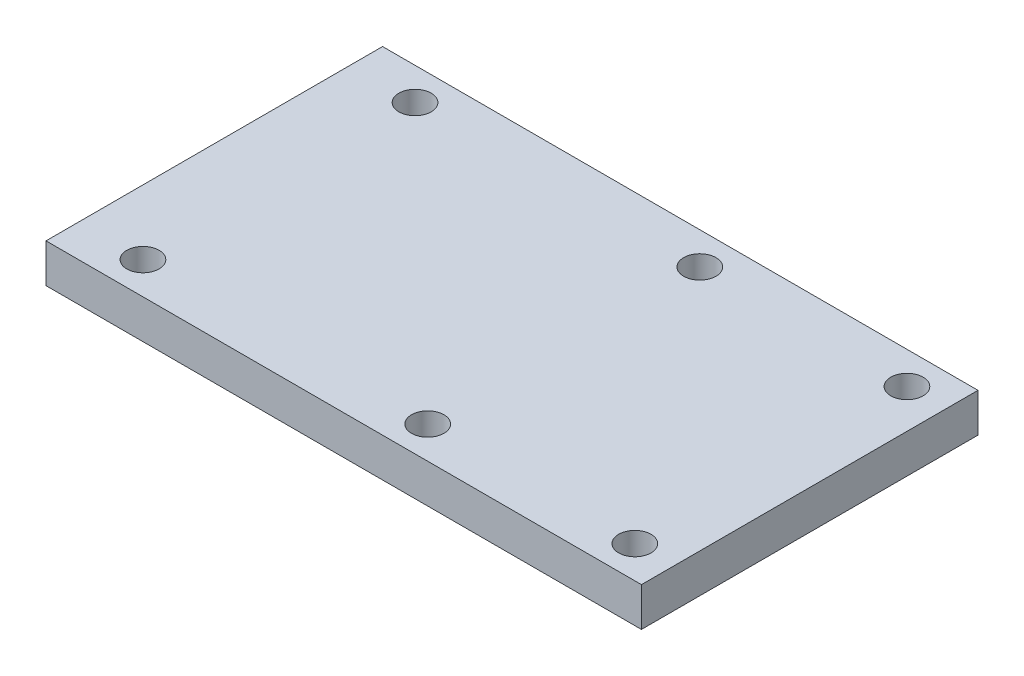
ISO-10303-21;
HEADER;
FILE_DESCRIPTION(('STEP AP214'),'2;1');
FILE_NAME('part.step','',(''),(''),'','','');
FILE_SCHEMA(('AUTOMOTIVE_DESIGN { 1 0 10303 214 1 1 1 1 }'));
ENDSEC;
DATA;
#1=APPLICATION_CONTEXT('core data for automotive mechanical design processes');
#2=APPLICATION_PROTOCOL_DEFINITION('international standard','automotive_design',2000,#1);
#3=PRODUCT_CONTEXT('',#1,'mechanical');
#4=PRODUCT('Part','Part','',(#3));
#5=PRODUCT_RELATED_PRODUCT_CATEGORY('part','',(#4));
#6=PRODUCT_DEFINITION_FORMATION('','',#4);
#7=PRODUCT_DEFINITION_CONTEXT('part definition',#1,'design');
#8=PRODUCT_DEFINITION('design','',#6,#7);
#9=PRODUCT_DEFINITION_SHAPE('','',#8);
#10=(LENGTH_UNIT() NAMED_UNIT(*) SI_UNIT(.MILLI.,.METRE.));
#11=(NAMED_UNIT(*) PLANE_ANGLE_UNIT() SI_UNIT($,.RADIAN.));
#12=(NAMED_UNIT(*) SI_UNIT($,.STERADIAN.) SOLID_ANGLE_UNIT());
#13=UNCERTAINTY_MEASURE_WITH_UNIT(LENGTH_MEASURE(1.E-05),#10,'distance_accuracy_value','');
#14=(GEOMETRIC_REPRESENTATION_CONTEXT(3) GLOBAL_UNCERTAINTY_ASSIGNED_CONTEXT((#13)) GLOBAL_UNIT_ASSIGNED_CONTEXT((#10,
#11,#12)) REPRESENTATION_CONTEXT('',''));
#15=CARTESIAN_POINT('',(0.,0.,0.));
#16=DIRECTION('',(0.,0.,1.));
#17=DIRECTION('',(1.,0.,0.));
#18=AXIS2_PLACEMENT_3D('',#15,#16,#17);
#19=CARTESIAN_POINT('',(-100.,15.,-70.));
#20=DIRECTION('',(0.,0.,1.));
#21=DIRECTION('',(1.,0.,0.));
#22=AXIS2_PLACEMENT_3D('',#19,#20,#21);
#23=PLANE('',#22);
#24=DIRECTION('',(-1.,0.,0.));
#25=VECTOR('',#24,1.);
#26=CARTESIAN_POINT('',(-100.,0.,-70.));
#27=LINE('',#26,#25);
#28=CARTESIAN_POINT('',(130.,0.,-70.));
#29=VERTEX_POINT('',#28);
#30=CARTESIAN_POINT('',(-100.,0.,-70.));
#31=VERTEX_POINT('',#30);
#32=EDGE_CURVE('E62',#29,#31,#27,.T.);
#33=ORIENTED_EDGE('',*,*,#32,.T.);
#34=DIRECTION('',(0.,-1.,0.));
#35=VECTOR('',#34,1.);
#36=CARTESIAN_POINT('',(-100.,15.,-70.));
#37=LINE('',#36,#35);
#38=CARTESIAN_POINT('',(-100.,15.,-70.));
#39=VERTEX_POINT('',#38);
#40=EDGE_CURVE('E11',#39,#31,#37,.T.);
#41=ORIENTED_EDGE('',*,*,#40,.F.);
#42=DIRECTION('',(-1.,0.,0.));
#43=VECTOR('',#42,1.);
#44=CARTESIAN_POINT('',(-100.,15.,-70.));
#45=LINE('',#44,#43);
#46=CARTESIAN_POINT('',(130.,15.,-70.));
#47=VERTEX_POINT('',#46);
#48=EDGE_CURVE('E87',#47,#39,#45,.T.);
#49=ORIENTED_EDGE('',*,*,#48,.F.);
#50=DIRECTION('',(0.,1.,0.));
#51=VECTOR('',#50,1.);
#52=CARTESIAN_POINT('',(130.,0.,-70.));
#53=LINE('',#52,#51);
#54=EDGE_CURVE('E95',#29,#47,#53,.T.);
#55=ORIENTED_EDGE('',*,*,#54,.F.);
#56=EDGE_LOOP('',(#33,#41,#49,#55));
#57=FACE_BOUND('',#56,.T.);
#58=ADVANCED_FACE('F33',(#57),#23,.F.);
#59=CARTESIAN_POINT('',(-100.,15.,60.));
#60=DIRECTION('',(1.,0.,0.));
#61=DIRECTION('',(0.,0.,-1.));
#62=AXIS2_PLACEMENT_3D('',#59,#60,#61);
#63=PLANE('',#62);
#64=DIRECTION('',(0.,0.,1.));
#65=VECTOR('',#64,1.);
#66=CARTESIAN_POINT('',(-100.,0.,60.));
#67=LINE('',#66,#65);
#68=CARTESIAN_POINT('',(-100.,0.,60.));
#69=VERTEX_POINT('',#68);
#70=EDGE_CURVE('E88',#31,#69,#67,.T.);
#71=ORIENTED_EDGE('',*,*,#70,.T.);
#72=DIRECTION('',(0.,-1.,0.));
#73=VECTOR('',#72,1.);
#74=CARTESIAN_POINT('',(-100.,15.,60.));
#75=LINE('',#74,#73);
#76=CARTESIAN_POINT('',(-100.,15.,60.));
#77=VERTEX_POINT('',#76);
#78=EDGE_CURVE('E42',#77,#69,#75,.T.);
#79=ORIENTED_EDGE('',*,*,#78,.F.);
#80=DIRECTION('',(0.,0.,1.));
#81=VECTOR('',#80,1.);
#82=CARTESIAN_POINT('',(-100.,15.,60.));
#83=LINE('',#82,#81);
#84=EDGE_CURVE('E51',#39,#77,#83,.T.);
#85=ORIENTED_EDGE('',*,*,#84,.F.);
#86=ORIENTED_EDGE('',*,*,#40,.T.);
#87=EDGE_LOOP('',(#71,#79,#85,#86));
#88=FACE_BOUND('',#87,.T.);
#89=ADVANCED_FACE('F216',(#88),#63,.F.);
#90=CARTESIAN_POINT('',(-100.,15.,60.));
#91=DIRECTION('',(0.,0.,-1.));
#92=DIRECTION('',(-1.,0.,0.));
#93=AXIS2_PLACEMENT_3D('',#90,#91,#92);
#94=PLANE('',#93);
#95=DIRECTION('',(1.,0.,0.));
#96=VECTOR('',#95,1.);
#97=CARTESIAN_POINT('',(-100.,0.,60.));
#98=LINE('',#97,#96);
#99=CARTESIAN_POINT('',(130.,0.,60.));
#100=VERTEX_POINT('',#99);
#101=EDGE_CURVE('E80',#69,#100,#98,.T.);
#102=ORIENTED_EDGE('',*,*,#101,.T.);
#103=DIRECTION('',(0.,-1.,0.));
#104=VECTOR('',#103,1.);
#105=CARTESIAN_POINT('',(130.,15.,60.));
#106=LINE('',#105,#104);
#107=CARTESIAN_POINT('',(130.,15.,60.));
#108=VERTEX_POINT('',#107);
#109=EDGE_CURVE('E84',#108,#100,#106,.T.);
#110=ORIENTED_EDGE('',*,*,#109,.F.);
#111=DIRECTION('',(1.,0.,0.));
#112=VECTOR('',#111,1.);
#113=CARTESIAN_POINT('',(-100.,15.,60.));
#114=LINE('',#113,#112);
#115=EDGE_CURVE('E67',#77,#108,#114,.T.);
#116=ORIENTED_EDGE('',*,*,#115,.F.);
#117=ORIENTED_EDGE('',*,*,#78,.T.);
#118=EDGE_LOOP('',(#102,#110,#116,#117));
#119=FACE_BOUND('',#118,.T.);
#120=ADVANCED_FACE('F82',(#119),#94,.F.);
#121=CARTESIAN_POINT('',(0.,15.,0.));
#122=DIRECTION('',(0.,-1.,0.));
#123=DIRECTION('',(0.,0.,-1.));
#124=AXIS2_PLACEMENT_3D('',#121,#122,#123);
#125=PLANE('',#124);
#126=CARTESIAN_POINT('',(115.,15.,47.55));
#127=DIRECTION('',(0.,1.,0.));
#128=DIRECTION('',(0.,0.,1.));
#129=AXIS2_PLACEMENT_3D('',#126,#127,#128);
#130=CIRCLE('',#129,6.25);
#131=CARTESIAN_POINT('',(115.,15.,53.8));
#132=VERTEX_POINT('',#131);
#133=EDGE_CURVE('E168',#132,#132,#130,.T.);
#134=ORIENTED_EDGE('',*,*,#133,.F.);
#135=EDGE_LOOP('',(#134));
#136=FACE_BOUND('',#135,.T.);
#137=CARTESIAN_POINT('',(115.,15.,-57.55));
#138=DIRECTION('',(0.,1.,0.));
#139=DIRECTION('',(0.,0.,1.));
#140=AXIS2_PLACEMENT_3D('',#137,#138,#139);
#141=CIRCLE('',#140,6.25);
#142=CARTESIAN_POINT('',(115.,15.,-51.3));
#143=VERTEX_POINT('',#142);
#144=EDGE_CURVE('E102',#143,#143,#141,.T.);
#145=ORIENTED_EDGE('',*,*,#144,.F.);
#146=EDGE_LOOP('',(#145));
#147=FACE_BOUND('',#146,.T.);
#148=CARTESIAN_POINT('',(35.,15.,-57.55));
#149=DIRECTION('',(0.,1.,0.));
#150=DIRECTION('',(0.,0.,1.));
#151=AXIS2_PLACEMENT_3D('',#148,#149,#150);
#152=CIRCLE('',#151,6.25);
#153=CARTESIAN_POINT('',(35.,15.,-51.3));
#154=VERTEX_POINT('',#153);
#155=EDGE_CURVE('E129',#154,#154,#152,.T.);
#156=ORIENTED_EDGE('',*,*,#155,.F.);
#157=EDGE_LOOP('',(#156));
#158=FACE_BOUND('',#157,.T.);
#159=CARTESIAN_POINT('',(-75.,15.,47.55));
#160=DIRECTION('',(0.,1.,0.));
#161=DIRECTION('',(0.,0.,1.));
#162=AXIS2_PLACEMENT_3D('',#159,#160,#161);
#163=CIRCLE('',#162,6.25);
#164=CARTESIAN_POINT('',(-75.,15.,53.8));
#165=VERTEX_POINT('',#164);
#166=EDGE_CURVE('E135',#165,#165,#163,.T.);
#167=ORIENTED_EDGE('',*,*,#166,.F.);
#168=EDGE_LOOP('',(#167));
#169=FACE_BOUND('',#168,.T.);
#170=CARTESIAN_POINT('',(35.,15.,47.55));
#171=DIRECTION('',(0.,1.,0.));
#172=DIRECTION('',(0.,0.,1.));
#173=AXIS2_PLACEMENT_3D('',#170,#171,#172);
#174=CIRCLE('',#173,6.25);
#175=CARTESIAN_POINT('',(35.,15.,53.8));
#176=VERTEX_POINT('',#175);
#177=EDGE_CURVE('E124',#176,#176,#174,.T.);
#178=ORIENTED_EDGE('',*,*,#177,.F.);
#179=EDGE_LOOP('',(#178));
#180=FACE_BOUND('',#179,.T.);
#181=CARTESIAN_POINT('',(-75.,15.,-57.55));
#182=DIRECTION('',(0.,1.,0.));
#183=DIRECTION('',(0.,0.,1.));
#184=AXIS2_PLACEMENT_3D('',#181,#182,#183);
#185=CIRCLE('',#184,6.25);
#186=CARTESIAN_POINT('',(-75.,15.,-51.3));
#187=VERTEX_POINT('',#186);
#188=EDGE_CURVE('E128',#187,#187,#185,.T.);
#189=ORIENTED_EDGE('',*,*,#188,.F.);
#190=EDGE_LOOP('',(#189));
#191=FACE_BOUND('',#190,.T.);
#192=ORIENTED_EDGE('',*,*,#115,.T.);
#193=DIRECTION('',(0.,0.,1.));
#194=VECTOR('',#193,1.);
#195=CARTESIAN_POINT('',(130.,15.,-70.));
#196=LINE('',#195,#194);
#197=EDGE_CURVE('E98',#47,#108,#196,.T.);
#198=ORIENTED_EDGE('',*,*,#197,.F.);
#199=ORIENTED_EDGE('',*,*,#48,.T.);
#200=ORIENTED_EDGE('',*,*,#84,.T.);
#201=EDGE_LOOP('',(#192,#198,#199,#200));
#202=FACE_BOUND('',#201,.T.);
#203=ADVANCED_FACE('F186',(#136,#147,#158,#169,#180,#191,#202),#125,.F.);
#204=CARTESIAN_POINT('',(0.,0.,0.));
#205=DIRECTION('',(0.,-1.,0.));
#206=DIRECTION('',(0.,0.,-1.));
#207=AXIS2_PLACEMENT_3D('',#204,#205,#206);
#208=PLANE('',#207);
#209=CARTESIAN_POINT('',(115.,0.,47.55));
#210=DIRECTION('',(0.,1.,0.));
#211=DIRECTION('',(0.,0.,1.));
#212=AXIS2_PLACEMENT_3D('',#209,#210,#211);
#213=CIRCLE('',#212,4.00000000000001);
#214=CARTESIAN_POINT('',(115.,0.,51.55));
#215=VERTEX_POINT('',#214);
#216=EDGE_CURVE('E175',#215,#215,#213,.T.);
#217=ORIENTED_EDGE('',*,*,#216,.T.);
#218=EDGE_LOOP('',(#217));
#219=FACE_BOUND('',#218,.T.);
#220=CARTESIAN_POINT('',(115.,0.,-57.55));
#221=DIRECTION('',(0.,1.,0.));
#222=DIRECTION('',(0.,0.,1.));
#223=AXIS2_PLACEMENT_3D('',#220,#221,#222);
#224=CIRCLE('',#223,4.00000000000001);
#225=CARTESIAN_POINT('',(115.,0.,-53.55));
#226=VERTEX_POINT('',#225);
#227=EDGE_CURVE('E164',#226,#226,#224,.T.);
#228=ORIENTED_EDGE('',*,*,#227,.T.);
#229=EDGE_LOOP('',(#228));
#230=FACE_BOUND('',#229,.T.);
#231=CARTESIAN_POINT('',(35.,0.,-57.55));
#232=DIRECTION('',(0.,-1.,0.));
#233=DIRECTION('',(0.,0.,-1.));
#234=AXIS2_PLACEMENT_3D('',#231,#232,#233);
#235=CIRCLE('',#234,4.);
#236=CARTESIAN_POINT('',(35.,0.,-61.55));
#237=VERTEX_POINT('',#236);
#238=EDGE_CURVE('E109',#237,#237,#235,.T.);
#239=ORIENTED_EDGE('',*,*,#238,.F.);
#240=EDGE_LOOP('',(#239));
#241=FACE_BOUND('',#240,.T.);
#242=CARTESIAN_POINT('',(-75.,0.,47.55));
#243=DIRECTION('',(0.,-1.,0.));
#244=DIRECTION('',(0.,0.,-1.));
#245=AXIS2_PLACEMENT_3D('',#242,#243,#244);
#246=CIRCLE('',#245,4.00000000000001);
#247=CARTESIAN_POINT('',(-75.,0.,43.55));
#248=VERTEX_POINT('',#247);
#249=EDGE_CURVE('E113',#248,#248,#246,.T.);
#250=ORIENTED_EDGE('',*,*,#249,.F.);
#251=EDGE_LOOP('',(#250));
#252=FACE_BOUND('',#251,.T.);
#253=CARTESIAN_POINT('',(35.,0.,47.55));
#254=DIRECTION('',(0.,-1.,0.));
#255=DIRECTION('',(0.,0.,-1.));
#256=AXIS2_PLACEMENT_3D('',#253,#254,#255);
#257=CIRCLE('',#256,4.);
#258=CARTESIAN_POINT('',(35.,0.,43.55));
#259=VERTEX_POINT('',#258);
#260=EDGE_CURVE('E117',#259,#259,#257,.T.);
#261=ORIENTED_EDGE('',*,*,#260,.F.);
#262=EDGE_LOOP('',(#261));
#263=FACE_BOUND('',#262,.T.);
#264=CARTESIAN_POINT('',(-75.,0.,-57.55));
#265=DIRECTION('',(0.,-1.,0.));
#266=DIRECTION('',(0.,0.,-1.));
#267=AXIS2_PLACEMENT_3D('',#264,#265,#266);
#268=CIRCLE('',#267,4.00000000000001);
#269=CARTESIAN_POINT('',(-75.,0.,-61.55));
#270=VERTEX_POINT('',#269);
#271=EDGE_CURVE('E121',#270,#270,#268,.T.);
#272=ORIENTED_EDGE('',*,*,#271,.F.);
#273=EDGE_LOOP('',(#272));
#274=FACE_BOUND('',#273,.T.);
#275=ORIENTED_EDGE('',*,*,#32,.F.);
#276=DIRECTION('',(0.,0.,-1.));
#277=VECTOR('',#276,1.);
#278=CARTESIAN_POINT('',(130.,0.,60.));
#279=LINE('',#278,#277);
#280=EDGE_CURVE('E91',#100,#29,#279,.T.);
#281=ORIENTED_EDGE('',*,*,#280,.F.);
#282=ORIENTED_EDGE('',*,*,#101,.F.);
#283=ORIENTED_EDGE('',*,*,#70,.F.);
#284=EDGE_LOOP('',(#275,#281,#282,#283));
#285=FACE_BOUND('',#284,.T.);
#286=ADVANCED_FACE('F92',(#219,#230,#241,#252,#263,#274,#285),#208,.T.);
#287=CARTESIAN_POINT('',(-75.,5.,-57.55));
#288=DIRECTION('',(0.,1.,0.));
#289=DIRECTION('',(0.,0.,1.));
#290=AXIS2_PLACEMENT_3D('',#287,#288,#289);
#291=CYLINDRICAL_SURFACE('',#290,6.25);
#292=CARTESIAN_POINT('',(-75.,5.,-57.55));
#293=DIRECTION('',(0.,1.,0.));
#294=DIRECTION('',(0.,0.,1.));
#295=AXIS2_PLACEMENT_3D('',#292,#293,#294);
#296=CIRCLE('',#295,6.25);
#297=CARTESIAN_POINT('',(-75.,5.,-51.3));
#298=VERTEX_POINT('',#297);
#299=EDGE_CURVE('E143',#298,#298,#296,.T.);
#300=ORIENTED_EDGE('',*,*,#299,.F.);
#301=EDGE_LOOP('',(#300));
#302=FACE_BOUND('',#301,.T.);
#303=ORIENTED_EDGE('',*,*,#188,.T.);
#304=EDGE_LOOP('',(#303));
#305=FACE_BOUND('',#304,.T.);
#306=ADVANCED_FACE('F199',(#302,#305),#291,.F.);
#307=CARTESIAN_POINT('',(-75.,5.,-57.55));
#308=DIRECTION('',(0.,1.,0.));
#309=DIRECTION('',(0.,0.,1.));
#310=AXIS2_PLACEMENT_3D('',#307,#308,#309);
#311=PLANE('',#310);
#312=CARTESIAN_POINT('',(-75.,5.,-57.55));
#313=DIRECTION('',(0.,1.,0.));
#314=DIRECTION('',(0.,0.,1.));
#315=AXIS2_PLACEMENT_3D('',#312,#313,#314);
#316=CIRCLE('',#315,4.00000000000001);
#317=CARTESIAN_POINT('',(-75.,5.,-53.55));
#318=VERTEX_POINT('',#317);
#319=EDGE_CURVE('E120',#318,#318,#316,.T.);
#320=ORIENTED_EDGE('',*,*,#319,.F.);
#321=EDGE_LOOP('',(#320));
#322=FACE_BOUND('',#321,.T.);
#323=ORIENTED_EDGE('',*,*,#299,.T.);
#324=EDGE_LOOP('',(#323));
#325=FACE_BOUND('',#324,.T.);
#326=ADVANCED_FACE('F201',(#322,#325),#311,.T.);
#327=CARTESIAN_POINT('',(35.,5.,47.55));
#328=DIRECTION('',(0.,1.,0.));
#329=DIRECTION('',(0.,0.,1.));
#330=AXIS2_PLACEMENT_3D('',#327,#328,#329);
#331=CYLINDRICAL_SURFACE('',#330,6.25);
#332=CARTESIAN_POINT('',(35.,5.,47.55));
#333=DIRECTION('',(0.,1.,0.));
#334=DIRECTION('',(0.,0.,1.));
#335=AXIS2_PLACEMENT_3D('',#332,#333,#334);
#336=CIRCLE('',#335,6.25);
#337=CARTESIAN_POINT('',(35.,5.,53.8));
#338=VERTEX_POINT('',#337);
#339=EDGE_CURVE('E138',#338,#338,#336,.T.);
#340=ORIENTED_EDGE('',*,*,#339,.F.);
#341=EDGE_LOOP('',(#340));
#342=FACE_BOUND('',#341,.T.);
#343=ORIENTED_EDGE('',*,*,#177,.T.);
#344=EDGE_LOOP('',(#343));
#345=FACE_BOUND('',#344,.T.);
#346=ADVANCED_FACE('F208',(#342,#345),#331,.F.);
#347=CARTESIAN_POINT('',(35.,5.,47.55));
#348=DIRECTION('',(0.,1.,0.));
#349=DIRECTION('',(0.,0.,1.));
#350=AXIS2_PLACEMENT_3D('',#347,#348,#349);
#351=PLANE('',#350);
#352=CARTESIAN_POINT('',(35.,5.,47.55));
#353=DIRECTION('',(0.,1.,0.));
#354=DIRECTION('',(0.,0.,1.));
#355=AXIS2_PLACEMENT_3D('',#352,#353,#354);
#356=CIRCLE('',#355,4.);
#357=CARTESIAN_POINT('',(35.,5.,51.55));
#358=VERTEX_POINT('',#357);
#359=EDGE_CURVE('E116',#358,#358,#356,.T.);
#360=ORIENTED_EDGE('',*,*,#359,.F.);
#361=EDGE_LOOP('',(#360));
#362=FACE_BOUND('',#361,.T.);
#363=ORIENTED_EDGE('',*,*,#339,.T.);
#364=EDGE_LOOP('',(#363));
#365=FACE_BOUND('',#364,.T.);
#366=ADVANCED_FACE('F398',(#362,#365),#351,.T.);
#367=CARTESIAN_POINT('',(-75.,5.,47.55));
#368=DIRECTION('',(0.,1.,0.));
#369=DIRECTION('',(0.,0.,1.));
#370=AXIS2_PLACEMENT_3D('',#367,#368,#369);
#371=CYLINDRICAL_SURFACE('',#370,6.25);
#372=CARTESIAN_POINT('',(-75.,5.,47.55));
#373=DIRECTION('',(0.,1.,0.));
#374=DIRECTION('',(0.,0.,1.));
#375=AXIS2_PLACEMENT_3D('',#372,#373,#374);
#376=CIRCLE('',#375,6.25);
#377=CARTESIAN_POINT('',(-75.,5.,53.8));
#378=VERTEX_POINT('',#377);
#379=EDGE_CURVE('E132',#378,#378,#376,.T.);
#380=ORIENTED_EDGE('',*,*,#379,.F.);
#381=EDGE_LOOP('',(#380));
#382=FACE_BOUND('',#381,.T.);
#383=ORIENTED_EDGE('',*,*,#166,.T.);
#384=EDGE_LOOP('',(#383));
#385=FACE_BOUND('',#384,.T.);
#386=ADVANCED_FACE('F389',(#382,#385),#371,.F.);
#387=CARTESIAN_POINT('',(-75.,5.,47.55));
#388=DIRECTION('',(0.,1.,0.));
#389=DIRECTION('',(0.,0.,1.));
#390=AXIS2_PLACEMENT_3D('',#387,#388,#389);
#391=PLANE('',#390);
#392=CARTESIAN_POINT('',(-75.,5.,47.55));
#393=DIRECTION('',(0.,1.,0.));
#394=DIRECTION('',(0.,0.,1.));
#395=AXIS2_PLACEMENT_3D('',#392,#393,#394);
#396=CIRCLE('',#395,4.00000000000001);
#397=CARTESIAN_POINT('',(-75.,5.,51.55));
#398=VERTEX_POINT('',#397);
#399=EDGE_CURVE('E112',#398,#398,#396,.T.);
#400=ORIENTED_EDGE('',*,*,#399,.F.);
#401=EDGE_LOOP('',(#400));
#402=FACE_BOUND('',#401,.T.);
#403=ORIENTED_EDGE('',*,*,#379,.T.);
#404=EDGE_LOOP('',(#403));
#405=FACE_BOUND('',#404,.T.);
#406=ADVANCED_FACE('F379',(#402,#405),#391,.T.);
#407=CARTESIAN_POINT('',(35.,5.,-57.55));
#408=DIRECTION('',(0.,1.,0.));
#409=DIRECTION('',(0.,0.,1.));
#410=AXIS2_PLACEMENT_3D('',#407,#408,#409);
#411=CYLINDRICAL_SURFACE('',#410,6.25);
#412=CARTESIAN_POINT('',(35.,5.,-57.55));
#413=DIRECTION('',(0.,1.,0.));
#414=DIRECTION('',(0.,0.,1.));
#415=AXIS2_PLACEMENT_3D('',#412,#413,#414);
#416=CIRCLE('',#415,6.25);
#417=CARTESIAN_POINT('',(35.,5.,-51.3));
#418=VERTEX_POINT('',#417);
#419=EDGE_CURVE('E125',#418,#418,#416,.T.);
#420=ORIENTED_EDGE('',*,*,#419,.F.);
#421=EDGE_LOOP('',(#420));
#422=FACE_BOUND('',#421,.T.);
#423=ORIENTED_EDGE('',*,*,#155,.T.);
#424=EDGE_LOOP('',(#423));
#425=FACE_BOUND('',#424,.T.);
#426=ADVANCED_FACE('F369',(#422,#425),#411,.F.);
#427=CARTESIAN_POINT('',(35.,5.,-57.55));
#428=DIRECTION('',(0.,1.,0.));
#429=DIRECTION('',(0.,0.,1.));
#430=AXIS2_PLACEMENT_3D('',#427,#428,#429);
#431=PLANE('',#430);
#432=CARTESIAN_POINT('',(35.,5.,-57.55));
#433=DIRECTION('',(0.,1.,0.));
#434=DIRECTION('',(0.,0.,1.));
#435=AXIS2_PLACEMENT_3D('',#432,#433,#434);
#436=CIRCLE('',#435,4.);
#437=CARTESIAN_POINT('',(35.,5.,-53.55));
#438=VERTEX_POINT('',#437);
#439=EDGE_CURVE('E108',#438,#438,#436,.T.);
#440=ORIENTED_EDGE('',*,*,#439,.F.);
#441=EDGE_LOOP('',(#440));
#442=FACE_BOUND('',#441,.T.);
#443=ORIENTED_EDGE('',*,*,#419,.T.);
#444=EDGE_LOOP('',(#443));
#445=FACE_BOUND('',#444,.T.);
#446=ADVANCED_FACE('F360',(#442,#445),#431,.T.);
#447=CARTESIAN_POINT('',(-75.,-33.,-57.55));
#448=DIRECTION('',(0.,1.,0.));
#449=DIRECTION('',(0.,0.,1.));
#450=AXIS2_PLACEMENT_3D('',#447,#448,#449);
#451=CYLINDRICAL_SURFACE('',#450,4.00000000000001);
#452=ORIENTED_EDGE('',*,*,#271,.T.);
#453=EDGE_LOOP('',(#452));
#454=FACE_BOUND('',#453,.T.);
#455=ORIENTED_EDGE('',*,*,#319,.T.);
#456=EDGE_LOOP('',(#455));
#457=FACE_BOUND('',#456,.T.);
#458=ADVANCED_FACE('F351',(#454,#457),#451,.F.);
#459=CARTESIAN_POINT('',(35.,-33.,-57.55));
#460=DIRECTION('',(0.,1.,0.));
#461=DIRECTION('',(0.,0.,1.));
#462=AXIS2_PLACEMENT_3D('',#459,#460,#461);
#463=CYLINDRICAL_SURFACE('',#462,4.);
#464=ORIENTED_EDGE('',*,*,#238,.T.);
#465=EDGE_LOOP('',(#464));
#466=FACE_BOUND('',#465,.T.);
#467=ORIENTED_EDGE('',*,*,#439,.T.);
#468=EDGE_LOOP('',(#467));
#469=FACE_BOUND('',#468,.T.);
#470=ADVANCED_FACE('F342',(#466,#469),#463,.F.);
#471=CARTESIAN_POINT('',(-75.,-33.,47.55));
#472=DIRECTION('',(0.,1.,0.));
#473=DIRECTION('',(0.,0.,1.));
#474=AXIS2_PLACEMENT_3D('',#471,#472,#473);
#475=CYLINDRICAL_SURFACE('',#474,4.00000000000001);
#476=ORIENTED_EDGE('',*,*,#249,.T.);
#477=EDGE_LOOP('',(#476));
#478=FACE_BOUND('',#477,.T.);
#479=ORIENTED_EDGE('',*,*,#399,.T.);
#480=EDGE_LOOP('',(#479));
#481=FACE_BOUND('',#480,.T.);
#482=ADVANCED_FACE('F333',(#478,#481),#475,.F.);
#483=CARTESIAN_POINT('',(35.,-33.,47.55));
#484=DIRECTION('',(0.,1.,0.));
#485=DIRECTION('',(0.,0.,1.));
#486=AXIS2_PLACEMENT_3D('',#483,#484,#485);
#487=CYLINDRICAL_SURFACE('',#486,4.);
#488=ORIENTED_EDGE('',*,*,#260,.T.);
#489=EDGE_LOOP('',(#488));
#490=FACE_BOUND('',#489,.T.);
#491=ORIENTED_EDGE('',*,*,#359,.T.);
#492=EDGE_LOOP('',(#491));
#493=FACE_BOUND('',#492,.T.);
#494=ADVANCED_FACE('F244',(#490,#493),#487,.F.);
#495=CARTESIAN_POINT('',(130.,0.,0.));
#496=DIRECTION('',(1.,0.,0.));
#497=DIRECTION('',(0.,0.,-1.));
#498=AXIS2_PLACEMENT_3D('',#495,#496,#497);
#499=PLANE('',#498);
#500=ORIENTED_EDGE('',*,*,#109,.T.);
#501=ORIENTED_EDGE('',*,*,#280,.T.);
#502=ORIENTED_EDGE('',*,*,#54,.T.);
#503=ORIENTED_EDGE('',*,*,#197,.T.);
#504=EDGE_LOOP('',(#500,#501,#502,#503));
#505=FACE_BOUND('',#504,.T.);
#506=ADVANCED_FACE('F97',(#505),#499,.T.);
#507=CARTESIAN_POINT('',(115.,5.,-57.55));
#508=DIRECTION('',(0.,1.,0.));
#509=DIRECTION('',(0.,0.,1.));
#510=AXIS2_PLACEMENT_3D('',#507,#508,#509);
#511=CYLINDRICAL_SURFACE('',#510,6.25);
#512=CARTESIAN_POINT('',(115.,5.,-57.55));
#513=DIRECTION('',(0.,1.,0.));
#514=DIRECTION('',(0.,0.,1.));
#515=AXIS2_PLACEMENT_3D('',#512,#513,#514);
#516=CIRCLE('',#515,6.25);
#517=CARTESIAN_POINT('',(115.,5.,-51.3));
#518=VERTEX_POINT('',#517);
#519=EDGE_CURVE('E99',#518,#518,#516,.T.);
#520=ORIENTED_EDGE('',*,*,#519,.F.);
#521=EDGE_LOOP('',(#520));
#522=FACE_BOUND('',#521,.T.);
#523=ORIENTED_EDGE('',*,*,#144,.T.);
#524=EDGE_LOOP('',(#523));
#525=FACE_BOUND('',#524,.T.);
#526=ADVANCED_FACE('F184',(#522,#525),#511,.F.);
#527=CARTESIAN_POINT('',(0.,5.,0.));
#528=DIRECTION('',(0.,1.,0.));
#529=DIRECTION('',(0.,0.,1.));
#530=AXIS2_PLACEMENT_3D('',#527,#528,#529);
#531=PLANE('',#530);
#532=CARTESIAN_POINT('',(115.,5.,-57.55));
#533=DIRECTION('',(0.,1.,0.));
#534=DIRECTION('',(0.,0.,1.));
#535=AXIS2_PLACEMENT_3D('',#532,#533,#534);
#536=CIRCLE('',#535,4.00000000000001);
#537=CARTESIAN_POINT('',(115.,5.,-53.55));
#538=VERTEX_POINT('',#537);
#539=EDGE_CURVE('E161',#538,#538,#536,.T.);
#540=ORIENTED_EDGE('',*,*,#539,.F.);
#541=EDGE_LOOP('',(#540));
#542=FACE_BOUND('',#541,.T.);
#543=ORIENTED_EDGE('',*,*,#519,.T.);
#544=EDGE_LOOP('',(#543));
#545=FACE_BOUND('',#544,.T.);
#546=ADVANCED_FACE('F250',(#542,#545),#531,.T.);
#547=CARTESIAN_POINT('',(115.,5.,47.55));
#548=DIRECTION('',(0.,1.,0.));
#549=DIRECTION('',(0.,0.,1.));
#550=AXIS2_PLACEMENT_3D('',#547,#548,#549);
#551=CYLINDRICAL_SURFACE('',#550,6.25);
#552=CARTESIAN_POINT('',(115.,5.,47.55));
#553=DIRECTION('',(0.,1.,0.));
#554=DIRECTION('',(0.,0.,1.));
#555=AXIS2_PLACEMENT_3D('',#552,#553,#554);
#556=CIRCLE('',#555,6.25);
#557=CARTESIAN_POINT('',(115.,5.,53.8));
#558=VERTEX_POINT('',#557);
#559=EDGE_CURVE('E163',#558,#558,#556,.T.);
#560=ORIENTED_EDGE('',*,*,#559,.F.);
#561=EDGE_LOOP('',(#560));
#562=FACE_BOUND('',#561,.T.);
#563=ORIENTED_EDGE('',*,*,#133,.T.);
#564=EDGE_LOOP('',(#563));
#565=FACE_BOUND('',#564,.T.);
#566=ADVANCED_FACE('F257',(#562,#565),#551,.F.);
#567=CARTESIAN_POINT('',(115.,5.,47.55));
#568=DIRECTION('',(0.,1.,0.));
#569=DIRECTION('',(0.,0.,1.));
#570=AXIS2_PLACEMENT_3D('',#567,#568,#569);
#571=PLANE('',#570);
#572=CARTESIAN_POINT('',(115.,5.,47.55));
#573=DIRECTION('',(0.,1.,0.));
#574=DIRECTION('',(0.,0.,1.));
#575=AXIS2_PLACEMENT_3D('',#572,#573,#574);
#576=CIRCLE('',#575,4.00000000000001);
#577=CARTESIAN_POINT('',(115.,5.,51.55));
#578=VERTEX_POINT('',#577);
#579=EDGE_CURVE('E36',#578,#578,#576,.T.);
#580=ORIENTED_EDGE('',*,*,#579,.F.);
#581=EDGE_LOOP('',(#580));
#582=FACE_BOUND('',#581,.T.);
#583=ORIENTED_EDGE('',*,*,#559,.T.);
#584=EDGE_LOOP('',(#583));
#585=FACE_BOUND('',#584,.T.);
#586=ADVANCED_FACE('F265',(#582,#585),#571,.T.);
#587=CARTESIAN_POINT('',(115.,0.,-57.55));
#588=DIRECTION('',(0.,1.,0.));
#589=DIRECTION('',(0.,0.,1.));
#590=AXIS2_PLACEMENT_3D('',#587,#588,#589);
#591=CYLINDRICAL_SURFACE('',#590,4.00000000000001);
#592=ORIENTED_EDGE('',*,*,#539,.T.);
#593=EDGE_LOOP('',(#592));
#594=FACE_BOUND('',#593,.T.);
#595=ORIENTED_EDGE('',*,*,#227,.F.);
#596=EDGE_LOOP('',(#595));
#597=FACE_BOUND('',#596,.T.);
#598=ADVANCED_FACE('F272',(#594,#597),#591,.F.);
#599=CARTESIAN_POINT('',(115.,0.,47.55));
#600=DIRECTION('',(0.,1.,0.));
#601=DIRECTION('',(0.,0.,1.));
#602=AXIS2_PLACEMENT_3D('',#599,#600,#601);
#603=CYLINDRICAL_SURFACE('',#602,4.00000000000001);
#604=ORIENTED_EDGE('',*,*,#579,.T.);
#605=EDGE_LOOP('',(#604));
#606=FACE_BOUND('',#605,.T.);
#607=ORIENTED_EDGE('',*,*,#216,.F.);
#608=EDGE_LOOP('',(#607));
#609=FACE_BOUND('',#608,.T.);
#610=ADVANCED_FACE('F280',(#606,#609),#603,.F.);
#611=CLOSED_SHELL('',(#58,#89,#120,#203,#286,#306,#326,#346,#366,#386,#406,#426,#446,#458,#470,
#482,#494,#506,#526,#546,#566,#586,#598,#610));
#612=MANIFOLD_SOLID_BREP('B2',#611);
#613=ADVANCED_BREP_SHAPE_REPRESENTATION('',(#18,#612),#14);
#614=SHAPE_DEFINITION_REPRESENTATION(#9,#613);
ENDSEC;
END-ISO-10303-21;
